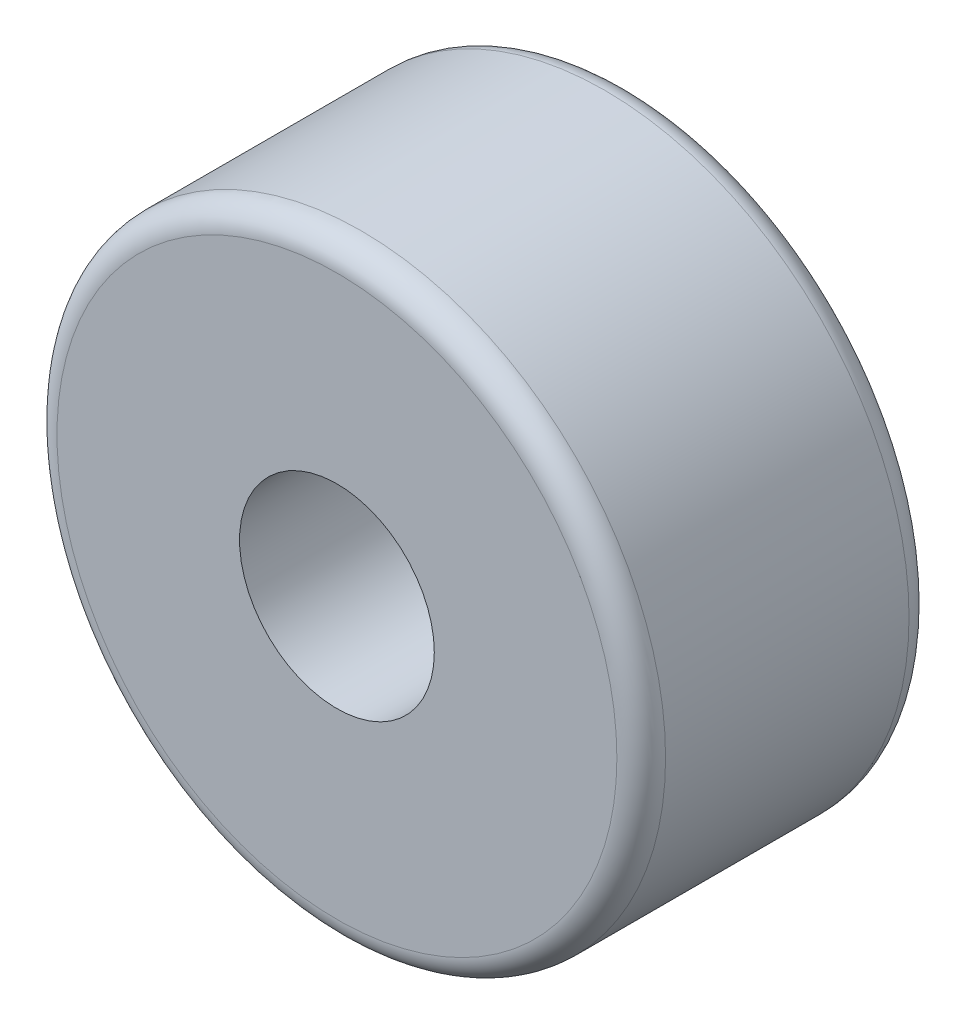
ISO-10303-21;
HEADER;
FILE_DESCRIPTION(('STEP AP214'),'2;1');
FILE_NAME('part.step','',(''),(''),'','','');
FILE_SCHEMA(('AUTOMOTIVE_DESIGN { 1 0 10303 214 1 1 1 1 }'));
ENDSEC;
DATA;
#1=APPLICATION_CONTEXT('core data for automotive mechanical design processes');
#2=APPLICATION_PROTOCOL_DEFINITION('international standard','automotive_design',2000,#1);
#3=PRODUCT_CONTEXT('',#1,'mechanical');
#4=PRODUCT('Part','Part','',(#3));
#5=PRODUCT_RELATED_PRODUCT_CATEGORY('part','',(#4));
#6=PRODUCT_DEFINITION_FORMATION('','',#4);
#7=PRODUCT_DEFINITION_CONTEXT('part definition',#1,'design');
#8=PRODUCT_DEFINITION('design','',#6,#7);
#9=PRODUCT_DEFINITION_SHAPE('','',#8);
#10=(LENGTH_UNIT() NAMED_UNIT(*) SI_UNIT(.MILLI.,.METRE.));
#11=(NAMED_UNIT(*) PLANE_ANGLE_UNIT() SI_UNIT($,.RADIAN.));
#12=(NAMED_UNIT(*) SI_UNIT($,.STERADIAN.) SOLID_ANGLE_UNIT());
#13=UNCERTAINTY_MEASURE_WITH_UNIT(LENGTH_MEASURE(1.E-05),#10,'distance_accuracy_value','');
#14=(GEOMETRIC_REPRESENTATION_CONTEXT(3) GLOBAL_UNCERTAINTY_ASSIGNED_CONTEXT((#13)) GLOBAL_UNIT_ASSIGNED_CONTEXT((#10,
#11,#12)) REPRESENTATION_CONTEXT('',''));
#15=CARTESIAN_POINT('',(0.,0.,0.));
#16=DIRECTION('',(0.,0.,1.));
#17=DIRECTION('',(1.,0.,0.));
#18=AXIS2_PLACEMENT_3D('',#15,#16,#17);
#19=CARTESIAN_POINT('',(0.,0.,1.));
#20=DIRECTION('',(0.,0.,1.));
#21=DIRECTION('',(1.,0.,0.));
#22=AXIS2_PLACEMENT_3D('',#19,#20,#21);
#23=TOROIDAL_SURFACE('',#22,11.5,1.);
#24=CARTESIAN_POINT('',(0.,0.,0.));
#25=DIRECTION('',(0.,0.,1.));
#26=DIRECTION('',(1.,0.,0.));
#27=AXIS2_PLACEMENT_3D('',#24,#25,#26);
#28=CIRCLE('',#27,11.5);
#29=CARTESIAN_POINT('',(11.5,0.,0.));
#30=VERTEX_POINT('',#29);
#31=EDGE_CURVE('E8',#30,#30,#28,.T.);
#32=ORIENTED_EDGE('',*,*,#31,.T.);
#33=EDGE_LOOP('',(#32));
#34=FACE_BOUND('',#33,.T.);
#35=CARTESIAN_POINT('',(0.,0.,1.));
#36=DIRECTION('',(0.,0.,1.));
#37=DIRECTION('',(1.,0.,0.));
#38=AXIS2_PLACEMENT_3D('',#35,#36,#37);
#39=CIRCLE('',#38,12.5);
#40=CARTESIAN_POINT('',(12.5,0.,1.));
#41=VERTEX_POINT('',#40);
#42=EDGE_CURVE('E34',#41,#41,#39,.T.);
#43=ORIENTED_EDGE('',*,*,#42,.F.);
#44=EDGE_LOOP('',(#43));
#45=FACE_BOUND('',#44,.T.);
#46=ADVANCED_FACE('F12',(#34,#45),#23,.T.);
#47=CARTESIAN_POINT('',(0.,-11.5,0.));
#48=DIRECTION('',(0.,0.,-1.));
#49=DIRECTION('',(-1.,0.,0.));
#50=AXIS2_PLACEMENT_3D('',#47,#48,#49);
#51=PLANE('',#50);
#52=CARTESIAN_POINT('',(0.,0.,0.));
#53=DIRECTION('',(0.,0.,1.));
#54=DIRECTION('',(1.,0.,0.));
#55=AXIS2_PLACEMENT_3D('',#52,#53,#54);
#56=CIRCLE('',#55,4.);
#57=CARTESIAN_POINT('',(4.,0.,0.));
#58=VERTEX_POINT('',#57);
#59=EDGE_CURVE('E18',#58,#58,#56,.T.);
#60=ORIENTED_EDGE('',*,*,#59,.T.);
#61=EDGE_LOOP('',(#60));
#62=FACE_BOUND('',#61,.T.);
#63=ORIENTED_EDGE('',*,*,#31,.F.);
#64=EDGE_LOOP('',(#63));
#65=FACE_BOUND('',#64,.T.);
#66=ADVANCED_FACE('F42',(#62,#65),#51,.T.);
#67=CARTESIAN_POINT('',(0.,0.,26.1502506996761));
#68=DIRECTION('',(0.,0.,1.));
#69=DIRECTION('',(1.,0.,0.));
#70=AXIS2_PLACEMENT_3D('',#67,#68,#69);
#71=CYLINDRICAL_SURFACE('',#70,4.);
#72=ORIENTED_EDGE('',*,*,#59,.F.);
#73=EDGE_LOOP('',(#72));
#74=FACE_BOUND('',#73,.T.);
#75=CARTESIAN_POINT('',(0.,0.,12.));
#76=DIRECTION('',(0.,0.,1.));
#77=DIRECTION('',(1.,0.,0.));
#78=AXIS2_PLACEMENT_3D('',#75,#76,#77);
#79=CIRCLE('',#78,4.);
#80=CARTESIAN_POINT('',(4.,0.,12.));
#81=VERTEX_POINT('',#80);
#82=EDGE_CURVE('E22',#81,#81,#79,.T.);
#83=ORIENTED_EDGE('',*,*,#82,.T.);
#84=EDGE_LOOP('',(#83));
#85=FACE_BOUND('',#84,.T.);
#86=ADVANCED_FACE('F48',(#74,#85),#71,.F.);
#87=CARTESIAN_POINT('',(0.,-4.,12.));
#88=DIRECTION('',(0.,0.,1.));
#89=DIRECTION('',(1.,0.,0.));
#90=AXIS2_PLACEMENT_3D('',#87,#88,#89);
#91=PLANE('',#90);
#92=CARTESIAN_POINT('',(0.,0.,12.));
#93=DIRECTION('',(0.,0.,1.));
#94=DIRECTION('',(1.,0.,0.));
#95=AXIS2_PLACEMENT_3D('',#92,#93,#94);
#96=CIRCLE('',#95,11.5);
#97=CARTESIAN_POINT('',(11.5,0.,12.));
#98=VERTEX_POINT('',#97);
#99=EDGE_CURVE('E26',#98,#98,#96,.T.);
#100=ORIENTED_EDGE('',*,*,#99,.T.);
#101=EDGE_LOOP('',(#100));
#102=FACE_BOUND('',#101,.T.);
#103=ORIENTED_EDGE('',*,*,#82,.F.);
#104=EDGE_LOOP('',(#103));
#105=FACE_BOUND('',#104,.T.);
#106=ADVANCED_FACE('F53',(#102,#105),#91,.T.);
#107=CARTESIAN_POINT('',(0.,0.,11.));
#108=DIRECTION('',(0.,0.,1.));
#109=DIRECTION('',(1.,0.,0.));
#110=AXIS2_PLACEMENT_3D('',#107,#108,#109);
#111=TOROIDAL_SURFACE('',#110,11.5,1.);
#112=CARTESIAN_POINT('',(0.,0.,11.));
#113=DIRECTION('',(0.,0.,1.));
#114=DIRECTION('',(1.,0.,0.));
#115=AXIS2_PLACEMENT_3D('',#112,#113,#114);
#116=CIRCLE('',#115,12.5);
#117=CARTESIAN_POINT('',(12.5,0.,11.));
#118=VERTEX_POINT('',#117);
#119=EDGE_CURVE('E31',#118,#118,#116,.T.);
#120=ORIENTED_EDGE('',*,*,#119,.T.);
#121=EDGE_LOOP('',(#120));
#122=FACE_BOUND('',#121,.T.);
#123=ORIENTED_EDGE('',*,*,#99,.F.);
#124=EDGE_LOOP('',(#123));
#125=FACE_BOUND('',#124,.T.);
#126=ADVANCED_FACE('F60',(#122,#125),#111,.T.);
#127=CARTESIAN_POINT('',(0.,0.,26.1502506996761));
#128=DIRECTION('',(0.,0.,1.));
#129=DIRECTION('',(1.,0.,0.));
#130=AXIS2_PLACEMENT_3D('',#127,#128,#129);
#131=CYLINDRICAL_SURFACE('',#130,12.5);
#132=ORIENTED_EDGE('',*,*,#42,.T.);
#133=EDGE_LOOP('',(#132));
#134=FACE_BOUND('',#133,.T.);
#135=ORIENTED_EDGE('',*,*,#119,.F.);
#136=EDGE_LOOP('',(#135));
#137=FACE_BOUND('',#136,.T.);
#138=ADVANCED_FACE('F38',(#134,#137),#131,.T.);
#139=CLOSED_SHELL('',(#46,#66,#86,#106,#126,#138));
#140=MANIFOLD_SOLID_BREP('B1',#139);
#141=ADVANCED_BREP_SHAPE_REPRESENTATION('',(#18,#140),#14);
#142=SHAPE_DEFINITION_REPRESENTATION(#9,#141);
ENDSEC;
END-ISO-10303-21;
